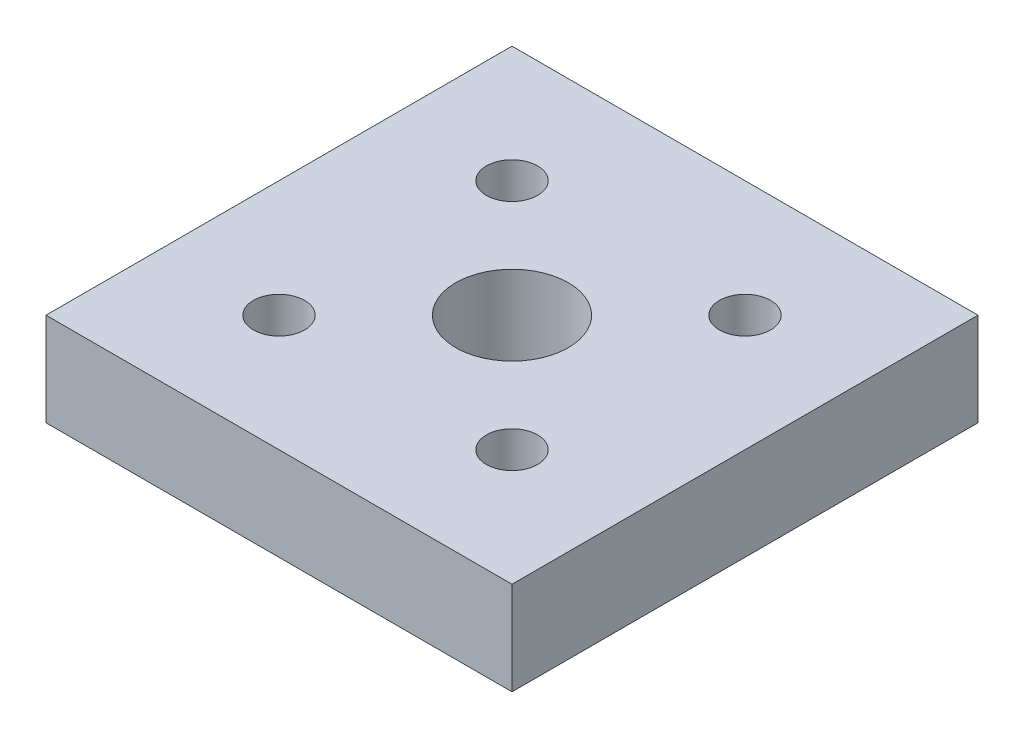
from build123d import *

# Parameters (mm, degrees)
SKETCH_1_W                = 60
SKETCH_1_H                = 60
EXTRUDE_1_DEPTH           = 12
M16X1_5_1_D               = 14.5
HOLE_WIZARD_1_D           = 6.6
HOLE_WIZARD_1_CBORE_D     = 11
HOLE_WIZARD_1_CBORE_DEPTH = 6.5


with BuildPart() as part:
    # Sketch 1 → Extrude 1 (new body)
    with BuildSketch(Plane(origin=(0, 0, 0), x_dir=(1, 0, 0), z_dir=(0, 1, 0))):
        with Locations((30, 30)):
            Rectangle(SKETCH_1_W, SKETCH_1_H)
    extrude(amount=EXTRUDE_1_DEPTH)

    # M16x1.5 _1 (through all)
    with Locations(Plane(origin=(30, 0, -30), x_dir=(0, 0, -1), z_dir=(0, -1, 0))):
        with Locations((0, 0)):
            Hole(M16X1_5_1_D / 2)

    # Hole Wizard 1 (through all)
    with Locations(Plane(origin=(15, 0, -15), x_dir=(0, 0, -1), z_dir=(0, -1, 0))):
        with Locations((0, 0), (0, 30), (30, 30), (30, 0)):
            CounterBoreHole(HOLE_WIZARD_1_D / 2, HOLE_WIZARD_1_CBORE_D / 2, HOLE_WIZARD_1_CBORE_DEPTH)


solid = part.part
